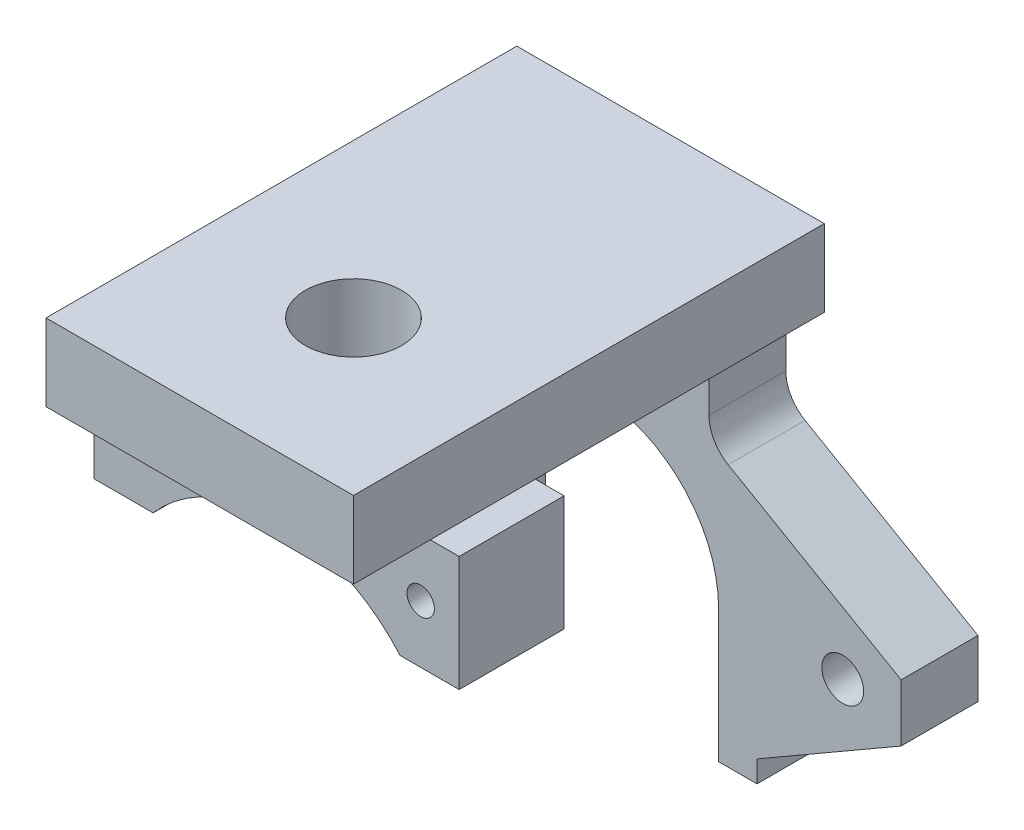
ISO-10303-21;
HEADER;
FILE_DESCRIPTION(('STEP AP214'),'2;1');
FILE_NAME('part.step','',(''),(''),'','','');
FILE_SCHEMA(('AUTOMOTIVE_DESIGN { 1 0 10303 214 1 1 1 1 }'));
ENDSEC;
DATA;
#1=APPLICATION_CONTEXT('core data for automotive mechanical design processes');
#2=APPLICATION_PROTOCOL_DEFINITION('international standard','automotive_design',2000,#1);
#3=PRODUCT_CONTEXT('',#1,'mechanical');
#4=PRODUCT('Part','Part','',(#3));
#5=PRODUCT_RELATED_PRODUCT_CATEGORY('part','',(#4));
#6=PRODUCT_DEFINITION_FORMATION('','',#4);
#7=PRODUCT_DEFINITION_CONTEXT('part definition',#1,'design');
#8=PRODUCT_DEFINITION('design','',#6,#7);
#9=PRODUCT_DEFINITION_SHAPE('','',#8);
#10=(LENGTH_UNIT() NAMED_UNIT(*) SI_UNIT(.MILLI.,.METRE.));
#11=(NAMED_UNIT(*) PLANE_ANGLE_UNIT() SI_UNIT($,.RADIAN.));
#12=(NAMED_UNIT(*) SI_UNIT($,.STERADIAN.) SOLID_ANGLE_UNIT());
#13=UNCERTAINTY_MEASURE_WITH_UNIT(LENGTH_MEASURE(1.E-05),#10,'distance_accuracy_value','');
#14=(GEOMETRIC_REPRESENTATION_CONTEXT(3) GLOBAL_UNCERTAINTY_ASSIGNED_CONTEXT((#13)) GLOBAL_UNIT_ASSIGNED_CONTEXT((#10,
#11,#12)) REPRESENTATION_CONTEXT('',''));
#15=CARTESIAN_POINT('',(0.,0.,0.));
#16=DIRECTION('',(0.,0.,1.));
#17=DIRECTION('',(1.,0.,0.));
#18=AXIS2_PLACEMENT_3D('',#15,#16,#17);
#19=CARTESIAN_POINT('',(25.4,0.,0.));
#20=DIRECTION('',(0.,0.,1.));
#21=DIRECTION('',(0.,-1.,0.));
#22=AXIS2_PLACEMENT_3D('',#19,#20,#21);
#23=PLANE('',#22);
#24=CARTESIAN_POINT('',(20.5739960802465,-25.4889,0.));
#25=DIRECTION('',(0.,0.,-1.));
#26=DIRECTION('',(0.,1.,0.));
#27=AXIS2_PLACEMENT_3D('',#24,#25,#26);
#28=CIRCLE('',#27,1.72719999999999);
#29=CARTESIAN_POINT('',(20.5739960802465,-23.7617,0.));
#30=VERTEX_POINT('',#29);
#31=EDGE_CURVE('E359',#30,#30,#28,.T.);
#32=ORIENTED_EDGE('',*,*,#31,.F.);
#33=EDGE_LOOP('',(#32));
#34=FACE_BOUND('',#33,.T.);
#35=CARTESIAN_POINT('',(-20.5740039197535,-25.4889,0.));
#36=DIRECTION('',(0.,0.,-1.));
#37=DIRECTION('',(0.,1.,0.));
#38=AXIS2_PLACEMENT_3D('',#35,#36,#37);
#39=CIRCLE('',#38,1.72719999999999);
#40=CARTESIAN_POINT('',(-20.5740039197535,-23.7617,0.));
#41=VERTEX_POINT('',#40);
#42=EDGE_CURVE('E353',#41,#41,#39,.T.);
#43=ORIENTED_EDGE('',*,*,#42,.F.);
#44=EDGE_LOOP('',(#43));
#45=FACE_BOUND('',#44,.T.);
#46=DIRECTION('',(-0.866025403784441,0.499999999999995,0.));
#47=VECTOR('',#46,1.);
#48=CARTESIAN_POINT('',(-25.4,-27.8511,0.));
#49=LINE('',#48,#47);
#50=CARTESIAN_POINT('',(-13.49375,-34.7251766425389,0.));
#51=VERTEX_POINT('',#50);
#52=CARTESIAN_POINT('',(-25.4,-27.8511,0.));
#53=VERTEX_POINT('',#52);
#54=EDGE_CURVE('E450',#51,#53,#49,.T.);
#55=ORIENTED_EDGE('',*,*,#54,.T.);
#56=DIRECTION('',(0.,1.,0.));
#57=VECTOR('',#56,1.);
#58=CARTESIAN_POINT('',(-25.4,0.,0.));
#59=LINE('',#58,#57);
#60=CARTESIAN_POINT('',(-25.4,-23.1174572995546,0.));
#61=VERTEX_POINT('',#60);
#62=EDGE_CURVE('E453',#53,#61,#59,.T.);
#63=ORIENTED_EDGE('',*,*,#62,.T.);
#64=DIRECTION('',(0.866025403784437,0.500000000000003,0.));
#65=VECTOR('',#64,1.);
#66=CARTESIAN_POINT('',(-25.4,-23.1174572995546,0.));
#67=LINE('',#66,#65);
#68=CARTESIAN_POINT('',(-11.1125,-14.8685653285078,0.));
#69=VERTEX_POINT('',#68);
#70=EDGE_CURVE('E1061',#61,#69,#67,.T.);
#71=ORIENTED_EDGE('',*,*,#70,.T.);
#72=CARTESIAN_POINT('',(-12.7,-12.1189346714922,0.));
#73=DIRECTION('',(0.,0.,1.));
#74=DIRECTION('',(1.,0.,0.));
#75=AXIS2_PLACEMENT_3D('',#72,#73,#74);
#76=CIRCLE('',#75,3.17500000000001);
#77=CARTESIAN_POINT('',(-9.525,-12.1189346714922,0.));
#78=VERTEX_POINT('',#77);
#79=EDGE_CURVE('E1063',#69,#78,#76,.T.);
#80=ORIENTED_EDGE('',*,*,#79,.T.);
#81=DIRECTION('',(0.,1.,0.));
#82=VECTOR('',#81,1.);
#83=CARTESIAN_POINT('',(-9.52500000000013,-9.525,0.));
#84=LINE('',#83,#82);
#85=CARTESIAN_POINT('',(-9.52500000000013,-9.525,0.));
#86=VERTEX_POINT('',#85);
#87=EDGE_CURVE('E505',#78,#86,#84,.T.);
#88=ORIENTED_EDGE('',*,*,#87,.T.);
#89=CARTESIAN_POINT('',(-12.7000000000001,-9.525,0.));
#90=DIRECTION('',(0.,0.,1.));
#91=DIRECTION('',(1.,0.,0.));
#92=AXIS2_PLACEMENT_3D('',#89,#90,#91);
#93=CIRCLE('',#92,3.175);
#94=CARTESIAN_POINT('',(-12.7,-6.35,0.));
#95=VERTEX_POINT('',#94);
#96=EDGE_CURVE('E500',#86,#95,#93,.T.);
#97=ORIENTED_EDGE('',*,*,#96,.T.);
#98=DIRECTION('',(0.,1.,0.));
#99=VECTOR('',#98,1.);
#100=CARTESIAN_POINT('',(-12.7,0.,0.));
#101=LINE('',#100,#99);
#102=CARTESIAN_POINT('',(-12.7,0.,0.));
#103=VERTEX_POINT('',#102);
#104=EDGE_CURVE('E497',#95,#103,#101,.T.);
#105=ORIENTED_EDGE('',*,*,#104,.T.);
#106=DIRECTION('',(-1.,0.,0.));
#107=VECTOR('',#106,1.);
#108=CARTESIAN_POINT('',(25.4,0.,0.));
#109=LINE('',#108,#107);
#110=CARTESIAN_POINT('',(12.7,0.,0.));
#111=VERTEX_POINT('',#110);
#112=EDGE_CURVE('E49',#111,#103,#109,.T.);
#113=ORIENTED_EDGE('',*,*,#112,.F.);
#114=DIRECTION('',(0.,-1.,0.));
#115=VECTOR('',#114,1.);
#116=CARTESIAN_POINT('',(12.7,0.,0.));
#117=LINE('',#116,#115);
#118=CARTESIAN_POINT('',(12.7,-6.35,0.));
#119=VERTEX_POINT('',#118);
#120=EDGE_CURVE('E494',#111,#119,#117,.T.);
#121=ORIENTED_EDGE('',*,*,#120,.T.);
#122=CARTESIAN_POINT('',(12.7000000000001,-9.525,0.));
#123=DIRECTION('',(0.,0.,1.));
#124=DIRECTION('',(-1.,0.,0.));
#125=AXIS2_PLACEMENT_3D('',#122,#123,#124);
#126=CIRCLE('',#125,3.175);
#127=CARTESIAN_POINT('',(9.52500000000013,-9.525,0.));
#128=VERTEX_POINT('',#127);
#129=EDGE_CURVE('E547',#119,#128,#126,.T.);
#130=ORIENTED_EDGE('',*,*,#129,.T.);
#131=DIRECTION('',(0.,-1.,0.));
#132=VECTOR('',#131,1.);
#133=CARTESIAN_POINT('',(9.52500000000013,-9.525,0.));
#134=LINE('',#133,#132);
#135=CARTESIAN_POINT('',(9.52500000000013,-12.1189346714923,0.));
#136=VERTEX_POINT('',#135);
#137=EDGE_CURVE('E549',#128,#136,#134,.T.);
#138=ORIENTED_EDGE('',*,*,#137,.T.);
#139=CARTESIAN_POINT('',(12.7,-12.1189346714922,0.));
#140=DIRECTION('',(0.,0.,1.));
#141=DIRECTION('',(-1.,0.,0.));
#142=AXIS2_PLACEMENT_3D('',#139,#140,#141);
#143=CIRCLE('',#142,3.17499999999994);
#144=CARTESIAN_POINT('',(11.1125000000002,-14.8685653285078,0.));
#145=VERTEX_POINT('',#144);
#146=EDGE_CURVE('E552',#136,#145,#143,.T.);
#147=ORIENTED_EDGE('',*,*,#146,.T.);
#148=DIRECTION('',(0.866025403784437,-0.500000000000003,0.));
#149=VECTOR('',#148,1.);
#150=CARTESIAN_POINT('',(25.4,-23.1174572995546,0.));
#151=LINE('',#150,#149);
#152=CARTESIAN_POINT('',(25.4,-23.1174572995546,0.));
#153=VERTEX_POINT('',#152);
#154=EDGE_CURVE('E555',#145,#153,#151,.T.);
#155=ORIENTED_EDGE('',*,*,#154,.T.);
#156=DIRECTION('',(0.,1.,0.));
#157=VECTOR('',#156,1.);
#158=CARTESIAN_POINT('',(25.4,0.,0.));
#159=LINE('',#158,#157);
#160=CARTESIAN_POINT('',(25.4,-27.8511,0.));
#161=VERTEX_POINT('',#160);
#162=EDGE_CURVE('E469',#161,#153,#159,.T.);
#163=ORIENTED_EDGE('',*,*,#162,.F.);
#164=DIRECTION('',(-0.866025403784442,-0.499999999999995,0.));
#165=VECTOR('',#164,1.);
#166=CARTESIAN_POINT('',(25.4,-27.8511,0.));
#167=LINE('',#166,#165);
#168=CARTESIAN_POINT('',(13.49375,-34.7251766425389,0.));
#169=VERTEX_POINT('',#168);
#170=EDGE_CURVE('E521',#161,#169,#167,.T.);
#171=ORIENTED_EDGE('',*,*,#170,.T.);
#172=DIRECTION('',(0.,-1.,0.));
#173=VECTOR('',#172,1.);
#174=CARTESIAN_POINT('',(13.49375,-34.7251766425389,0.));
#175=LINE('',#174,#173);
#176=CARTESIAN_POINT('',(13.49375,-36.5125,0.));
#177=VERTEX_POINT('',#176);
#178=EDGE_CURVE('E524',#169,#177,#175,.T.);
#179=ORIENTED_EDGE('',*,*,#178,.T.);
#180=DIRECTION('',(-1.,0.,0.));
#181=VECTOR('',#180,1.);
#182=CARTESIAN_POINT('',(25.4,-36.5125,0.));
#183=LINE('',#182,#181);
#184=CARTESIAN_POINT('',(10.31875,-36.5125,0.));
#185=VERTEX_POINT('',#184);
#186=EDGE_CURVE('E478',#177,#185,#183,.T.);
#187=ORIENTED_EDGE('',*,*,#186,.T.);
#188=DIRECTION('',(0.,-1.,0.));
#189=VECTOR('',#188,1.);
#190=CARTESIAN_POINT('',(10.31875,-25.5016,0.));
#191=LINE('',#190,#189);
#192=CARTESIAN_POINT('',(10.31875,-25.5016,0.));
#193=VERTEX_POINT('',#192);
#194=EDGE_CURVE('E588',#193,#185,#191,.T.);
#195=ORIENTED_EDGE('',*,*,#194,.F.);
#196=CARTESIAN_POINT('',(0.,-25.5016,0.));
#197=DIRECTION('',(0.,0.,-1.));
#198=DIRECTION('',(0.,1.,0.));
#199=AXIS2_PLACEMENT_3D('',#196,#197,#198);
#200=CIRCLE('',#199,10.31875);
#201=CARTESIAN_POINT('',(-10.31875,-25.5016,0.));
#202=VERTEX_POINT('',#201);
#203=EDGE_CURVE('E591',#202,#193,#200,.T.);
#204=ORIENTED_EDGE('',*,*,#203,.F.);
#205=DIRECTION('',(0.,1.,0.));
#206=VECTOR('',#205,1.);
#207=CARTESIAN_POINT('',(-10.31875,-25.5016,0.));
#208=LINE('',#207,#206);
#209=CARTESIAN_POINT('',(-10.31875,-36.5125,0.));
#210=VERTEX_POINT('',#209);
#211=EDGE_CURVE('E584',#210,#202,#208,.T.);
#212=ORIENTED_EDGE('',*,*,#211,.F.);
#213=CARTESIAN_POINT('',(-13.49375,-36.5125,0.));
#214=VERTEX_POINT('',#213);
#215=EDGE_CURVE('E481',#210,#214,#183,.T.);
#216=ORIENTED_EDGE('',*,*,#215,.T.);
#217=DIRECTION('',(0.,1.,0.));
#218=VECTOR('',#217,1.);
#219=CARTESIAN_POINT('',(-13.49375,-34.7251766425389,0.));
#220=LINE('',#219,#218);
#221=EDGE_CURVE('E63',#214,#51,#220,.T.);
#222=ORIENTED_EDGE('',*,*,#221,.T.);
#223=EDGE_LOOP('',(#55,#63,#71,#80,#88,#97,#105,#113,#121,#130,#138,#147,#155,#163,#171,#179,
#187,#195,#204,#212,#216,#222));
#224=FACE_BOUND('',#223,.T.);
#225=ADVANCED_FACE('F42',(#34,#45,#224),#23,.F.);
#226=CARTESIAN_POINT('',(25.4,-6.35,6.35));
#227=DIRECTION('',(0.,0.,-1.));
#228=DIRECTION('',(0.,1.,0.));
#229=AXIS2_PLACEMENT_3D('',#226,#227,#228);
#230=PLANE('',#229);
#231=CARTESIAN_POINT('',(20.5739960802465,-25.4889,6.35));
#232=DIRECTION('',(0.,0.,-1.));
#233=DIRECTION('',(0.,1.,0.));
#234=AXIS2_PLACEMENT_3D('',#231,#232,#233);
#235=CIRCLE('',#234,1.72719999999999);
#236=CARTESIAN_POINT('',(20.5739960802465,-23.7617,6.35));
#237=VERTEX_POINT('',#236);
#238=EDGE_CURVE('E356',#237,#237,#235,.T.);
#239=ORIENTED_EDGE('',*,*,#238,.T.);
#240=EDGE_LOOP('',(#239));
#241=FACE_BOUND('',#240,.T.);
#242=CARTESIAN_POINT('',(-20.5740039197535,-25.4889,6.35));
#243=DIRECTION('',(0.,0.,-1.));
#244=DIRECTION('',(0.,1.,0.));
#245=AXIS2_PLACEMENT_3D('',#242,#243,#244);
#246=CIRCLE('',#245,1.72719999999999);
#247=CARTESIAN_POINT('',(-20.5740039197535,-23.7617,6.35));
#248=VERTEX_POINT('',#247);
#249=EDGE_CURVE('E350',#248,#248,#246,.T.);
#250=ORIENTED_EDGE('',*,*,#249,.T.);
#251=EDGE_LOOP('',(#250));
#252=FACE_BOUND('',#251,.T.);
#253=DIRECTION('',(0.866025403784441,-0.499999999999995,0.));
#254=VECTOR('',#253,1.);
#255=CARTESIAN_POINT('',(-25.4,-27.8511,6.34999999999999));
#256=LINE('',#255,#254);
#257=CARTESIAN_POINT('',(-25.4,-27.8511,6.35));
#258=VERTEX_POINT('',#257);
#259=CARTESIAN_POINT('',(-13.49375,-34.7251766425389,6.34999999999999));
#260=VERTEX_POINT('',#259);
#261=EDGE_CURVE('E457',#258,#260,#256,.T.);
#262=ORIENTED_EDGE('',*,*,#261,.T.);
#263=DIRECTION('',(0.,-1.,0.));
#264=VECTOR('',#263,1.);
#265=CARTESIAN_POINT('',(-13.49375,-34.7251766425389,6.34999999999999));
#266=LINE('',#265,#264);
#267=CARTESIAN_POINT('',(-13.49375,-36.5125,6.34999999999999));
#268=VERTEX_POINT('',#267);
#269=EDGE_CURVE('E1036',#260,#268,#266,.T.);
#270=ORIENTED_EDGE('',*,*,#269,.T.);
#271=DIRECTION('',(-1.,0.,0.));
#272=VECTOR('',#271,1.);
#273=CARTESIAN_POINT('',(25.4,-36.5125,6.35));
#274=LINE('',#273,#272);
#275=CARTESIAN_POINT('',(-10.31875,-36.5125,6.34999999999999));
#276=VERTEX_POINT('',#275);
#277=EDGE_CURVE('E480',#276,#268,#274,.T.);
#278=ORIENTED_EDGE('',*,*,#277,.F.);
#279=DIRECTION('',(0.,-1.,0.));
#280=VECTOR('',#279,1.);
#281=CARTESIAN_POINT('',(-10.31875,-25.5016,6.34999999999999));
#282=LINE('',#281,#280);
#283=CARTESIAN_POINT('',(-10.31875,-25.5016,6.34999999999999));
#284=VERTEX_POINT('',#283);
#285=EDGE_CURVE('E594',#284,#276,#282,.T.);
#286=ORIENTED_EDGE('',*,*,#285,.F.);
#287=CARTESIAN_POINT('',(0.,-25.5016,6.34999999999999));
#288=DIRECTION('',(0.,0.,-1.));
#289=DIRECTION('',(0.,1.,0.));
#290=AXIS2_PLACEMENT_3D('',#287,#288,#289);
#291=CIRCLE('',#290,10.31875);
#292=CARTESIAN_POINT('',(10.31875,-25.5016,6.34999999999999));
#293=VERTEX_POINT('',#292);
#294=EDGE_CURVE('E596',#293,#284,#291,.F.);
#295=ORIENTED_EDGE('',*,*,#294,.F.);
#296=DIRECTION('',(0.,1.,0.));
#297=VECTOR('',#296,1.);
#298=CARTESIAN_POINT('',(10.31875,-25.5016,6.34999999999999));
#299=LINE('',#298,#297);
#300=CARTESIAN_POINT('',(10.31875,-36.5125,6.34999999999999));
#301=VERTEX_POINT('',#300);
#302=EDGE_CURVE('E467',#301,#293,#299,.T.);
#303=ORIENTED_EDGE('',*,*,#302,.F.);
#304=CARTESIAN_POINT('',(13.49375,-36.5125,6.35));
#305=VERTEX_POINT('',#304);
#306=EDGE_CURVE('E482',#305,#301,#274,.T.);
#307=ORIENTED_EDGE('',*,*,#306,.F.);
#308=DIRECTION('',(0.,1.,0.));
#309=VECTOR('',#308,1.);
#310=CARTESIAN_POINT('',(13.49375,-34.7251766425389,6.34999999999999));
#311=LINE('',#310,#309);
#312=CARTESIAN_POINT('',(13.49375,-34.7251766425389,6.34999999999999));
#313=VERTEX_POINT('',#312);
#314=EDGE_CURVE('E515',#305,#313,#311,.T.);
#315=ORIENTED_EDGE('',*,*,#314,.T.);
#316=DIRECTION('',(0.866025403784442,0.499999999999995,0.));
#317=VECTOR('',#316,1.);
#318=CARTESIAN_POINT('',(25.4,-27.8511,6.34999999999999));
#319=LINE('',#318,#317);
#320=CARTESIAN_POINT('',(25.4,-27.8511,6.35));
#321=VERTEX_POINT('',#320);
#322=EDGE_CURVE('E518',#313,#321,#319,.T.);
#323=ORIENTED_EDGE('',*,*,#322,.T.);
#324=DIRECTION('',(0.,-1.,0.));
#325=VECTOR('',#324,1.);
#326=CARTESIAN_POINT('',(25.4,-6.35,6.35));
#327=LINE('',#326,#325);
#328=CARTESIAN_POINT('',(25.4,-23.1174572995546,6.34999999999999));
#329=VERTEX_POINT('',#328);
#330=EDGE_CURVE('E475',#329,#321,#327,.T.);
#331=ORIENTED_EDGE('',*,*,#330,.F.);
#332=DIRECTION('',(-0.866025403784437,0.500000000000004,0.));
#333=VECTOR('',#332,1.);
#334=CARTESIAN_POINT('',(25.4,-23.1174572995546,6.34999999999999));
#335=LINE('',#334,#333);
#336=CARTESIAN_POINT('',(11.1125000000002,-14.8685653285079,6.35));
#337=VERTEX_POINT('',#336);
#338=EDGE_CURVE('E534',#329,#337,#335,.T.);
#339=ORIENTED_EDGE('',*,*,#338,.T.);
#340=CARTESIAN_POINT('',(12.7,-12.1189346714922,6.34999999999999));
#341=DIRECTION('',(0.,0.,-1.));
#342=DIRECTION('',(0.,1.,0.));
#343=AXIS2_PLACEMENT_3D('',#340,#341,#342);
#344=CIRCLE('',#343,3.17499999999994);
#345=CARTESIAN_POINT('',(9.52500000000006,-12.1189346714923,6.34999999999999));
#346=VERTEX_POINT('',#345);
#347=EDGE_CURVE('E537',#337,#346,#344,.T.);
#348=ORIENTED_EDGE('',*,*,#347,.T.);
#349=DIRECTION('',(0.,1.,0.));
#350=VECTOR('',#349,1.);
#351=CARTESIAN_POINT('',(9.52500000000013,-9.52499999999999,6.34999999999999));
#352=LINE('',#351,#350);
#353=CARTESIAN_POINT('',(9.52500000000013,-9.525,6.34999999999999));
#354=VERTEX_POINT('',#353);
#355=EDGE_CURVE('E540',#346,#354,#352,.T.);
#356=ORIENTED_EDGE('',*,*,#355,.T.);
#357=CARTESIAN_POINT('',(12.7000000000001,-9.525,6.34999999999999));
#358=DIRECTION('',(0.,0.,-1.));
#359=DIRECTION('',(0.,1.,0.));
#360=AXIS2_PLACEMENT_3D('',#357,#358,#359);
#361=CIRCLE('',#360,3.175);
#362=CARTESIAN_POINT('',(12.7,-6.35,6.35));
#363=VERTEX_POINT('',#362);
#364=EDGE_CURVE('E543',#354,#363,#361,.T.);
#365=ORIENTED_EDGE('',*,*,#364,.T.);
#366=DIRECTION('',(-1.,0.,0.));
#367=VECTOR('',#366,1.);
#368=CARTESIAN_POINT('',(25.4,-6.35,6.35));
#369=LINE('',#368,#367);
#370=CARTESIAN_POINT('',(-12.7,-6.35,6.35));
#371=VERTEX_POINT('',#370);
#372=EDGE_CURVE('E484',#363,#371,#369,.T.);
#373=ORIENTED_EDGE('',*,*,#372,.T.);
#374=CARTESIAN_POINT('',(-12.7000000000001,-9.525,6.34999999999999));
#375=DIRECTION('',(0.,0.,-1.));
#376=DIRECTION('',(0.,1.,0.));
#377=AXIS2_PLACEMENT_3D('',#374,#375,#376);
#378=CIRCLE('',#377,3.175);
#379=CARTESIAN_POINT('',(-9.52500000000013,-9.525,6.34999999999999));
#380=VERTEX_POINT('',#379);
#381=EDGE_CURVE('E1050',#371,#380,#378,.T.);
#382=ORIENTED_EDGE('',*,*,#381,.T.);
#383=DIRECTION('',(0.,-1.,0.));
#384=VECTOR('',#383,1.);
#385=CARTESIAN_POINT('',(-9.52500000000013,-9.52499999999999,6.34999999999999));
#386=LINE('',#385,#384);
#387=CARTESIAN_POINT('',(-9.525,-12.1189346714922,6.34999999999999));
#388=VERTEX_POINT('',#387);
#389=EDGE_CURVE('E1053',#380,#388,#386,.T.);
#390=ORIENTED_EDGE('',*,*,#389,.T.);
#391=CARTESIAN_POINT('',(-12.7,-12.1189346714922,6.34999999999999));
#392=DIRECTION('',(0.,0.,-1.));
#393=DIRECTION('',(0.,1.,0.));
#394=AXIS2_PLACEMENT_3D('',#391,#392,#393);
#395=CIRCLE('',#394,3.17500000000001);
#396=CARTESIAN_POINT('',(-11.1125,-14.8685653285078,6.34999999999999));
#397=VERTEX_POINT('',#396);
#398=EDGE_CURVE('E1056',#388,#397,#395,.T.);
#399=ORIENTED_EDGE('',*,*,#398,.T.);
#400=DIRECTION('',(-0.866025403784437,-0.500000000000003,0.));
#401=VECTOR('',#400,1.);
#402=CARTESIAN_POINT('',(-25.4,-23.1174572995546,6.34999999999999));
#403=LINE('',#402,#401);
#404=CARTESIAN_POINT('',(-25.4,-23.1174572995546,6.35));
#405=VERTEX_POINT('',#404);
#406=EDGE_CURVE('E1059',#397,#405,#403,.T.);
#407=ORIENTED_EDGE('',*,*,#406,.T.);
#408=DIRECTION('',(0.,-1.,0.));
#409=VECTOR('',#408,1.);
#410=CARTESIAN_POINT('',(-25.4,-6.35,6.35));
#411=LINE('',#410,#409);
#412=EDGE_CURVE('E466',#405,#258,#411,.T.);
#413=ORIENTED_EDGE('',*,*,#412,.T.);
#414=EDGE_LOOP('',(#262,#270,#278,#286,#295,#303,#307,#315,#323,#331,#339,#348,#356,#365,#373,
#382,#390,#399,#407,#413));
#415=FACE_BOUND('',#414,.T.);
#416=ADVANCED_FACE('F436',(#241,#252,#415),#230,.F.);
#417=CARTESIAN_POINT('',(-25.4,0.,0.));
#418=DIRECTION('',(-1.,0.,0.));
#419=DIRECTION('',(0.,0.,1.));
#420=AXIS2_PLACEMENT_3D('',#417,#418,#419);
#421=PLANE('',#420);
#422=ORIENTED_EDGE('',*,*,#62,.F.);
#423=DIRECTION('',(0.,0.,-1.));
#424=VECTOR('',#423,1.);
#425=CARTESIAN_POINT('',(-25.4,-27.8511,81.789));
#426=LINE('',#425,#424);
#427=EDGE_CURVE('E463',#258,#53,#426,.T.);
#428=ORIENTED_EDGE('',*,*,#427,.F.);
#429=ORIENTED_EDGE('',*,*,#412,.F.);
#430=DIRECTION('',(0.,0.,-1.));
#431=VECTOR('',#430,1.);
#432=CARTESIAN_POINT('',(-25.4,-23.1174572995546,81.789));
#433=LINE('',#432,#431);
#434=EDGE_CURVE('E465',#405,#61,#433,.T.);
#435=ORIENTED_EDGE('',*,*,#434,.T.);
#436=EDGE_LOOP('',(#422,#428,#429,#435));
#437=FACE_BOUND('',#436,.T.);
#438=ADVANCED_FACE('F441',(#437),#421,.T.);
#439=CARTESIAN_POINT('',(25.4,-36.5125,6.35));
#440=DIRECTION('',(0.,1.,0.));
#441=DIRECTION('',(0.,0.,1.));
#442=AXIS2_PLACEMENT_3D('',#439,#440,#441);
#443=PLANE('',#442);
#444=DIRECTION('',(0.,0.,-1.));
#445=VECTOR('',#444,1.);
#446=CARTESIAN_POINT('',(-13.49375,-36.5125,81.789));
#447=LINE('',#446,#445);
#448=EDGE_CURVE('E1046',#268,#214,#447,.T.);
#449=ORIENTED_EDGE('',*,*,#448,.T.);
#450=ORIENTED_EDGE('',*,*,#215,.F.);
#451=DIRECTION('',(0.,0.,-1.));
#452=VECTOR('',#451,1.);
#453=CARTESIAN_POINT('',(-10.31875,-36.5125,81.789));
#454=LINE('',#453,#452);
#455=EDGE_CURVE('E599',#276,#210,#454,.T.);
#456=ORIENTED_EDGE('',*,*,#455,.F.);
#457=ORIENTED_EDGE('',*,*,#277,.T.);
#458=EDGE_LOOP('',(#449,#450,#456,#457));
#459=FACE_BOUND('',#458,.T.);
#460=ADVANCED_FACE('F694',(#459),#443,.F.);
#461=CARTESIAN_POINT('',(25.4,0.,0.));
#462=DIRECTION('',(0.,-1.,0.));
#463=DIRECTION('',(0.,0.,-1.));
#464=AXIS2_PLACEMENT_3D('',#461,#462,#463);
#465=PLANE('',#464);
#466=CARTESIAN_POINT('',(0.,0.,26.19375));
#467=DIRECTION('',(0.,-1.,0.));
#468=DIRECTION('',(0.,0.,-1.));
#469=AXIS2_PLACEMENT_3D('',#466,#467,#468);
#470=CIRCLE('',#469,3.96875);
#471=CARTESIAN_POINT('',(0.,0.,22.225));
#472=VERTEX_POINT('',#471);
#473=EDGE_CURVE('E362',#472,#472,#470,.F.);
#474=ORIENTED_EDGE('',*,*,#473,.F.);
#475=EDGE_LOOP('',(#474));
#476=FACE_BOUND('',#475,.T.);
#477=DIRECTION('',(0.,0.,1.));
#478=VECTOR('',#477,1.);
#479=CARTESIAN_POINT('',(-12.7,0.,81.788));
#480=LINE('',#479,#478);
#481=CARTESIAN_POINT('',(-12.7,0.,38.89375));
#482=VERTEX_POINT('',#481);
#483=EDGE_CURVE('E281',#103,#482,#480,.T.);
#484=ORIENTED_EDGE('',*,*,#483,.T.);
#485=DIRECTION('',(1.,0.,0.));
#486=VECTOR('',#485,1.);
#487=CARTESIAN_POINT('',(25.4,0.,38.89375));
#488=LINE('',#487,#486);
#489=CARTESIAN_POINT('',(12.7,0.,38.89375));
#490=VERTEX_POINT('',#489);
#491=EDGE_CURVE('E56',#482,#490,#488,.T.);
#492=ORIENTED_EDGE('',*,*,#491,.T.);
#493=DIRECTION('',(0.,0.,-1.));
#494=VECTOR('',#493,1.);
#495=CARTESIAN_POINT('',(12.7,0.,81.788));
#496=LINE('',#495,#494);
#497=EDGE_CURVE('E489',#490,#111,#496,.T.);
#498=ORIENTED_EDGE('',*,*,#497,.T.);
#499=ORIENTED_EDGE('',*,*,#112,.T.);
#500=EDGE_LOOP('',(#484,#492,#498,#499));
#501=FACE_BOUND('',#500,.T.);
#502=ADVANCED_FACE('F487',(#476,#501),#465,.F.);
#503=CARTESIAN_POINT('',(25.4,0.,0.));
#504=DIRECTION('',(-1.,0.,0.));
#505=DIRECTION('',(0.,0.,1.));
#506=AXIS2_PLACEMENT_3D('',#503,#504,#505);
#507=PLANE('',#506);
#508=DIRECTION('',(0.,0.,-1.));
#509=VECTOR('',#508,1.);
#510=CARTESIAN_POINT('',(25.4,-27.8511,81.789));
#511=LINE('',#510,#509);
#512=EDGE_CURVE('E531',#321,#161,#511,.T.);
#513=ORIENTED_EDGE('',*,*,#512,.T.);
#514=ORIENTED_EDGE('',*,*,#162,.T.);
#515=DIRECTION('',(0.,0.,-1.));
#516=VECTOR('',#515,1.);
#517=CARTESIAN_POINT('',(25.4,-23.1174572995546,81.789));
#518=LINE('',#517,#516);
#519=EDGE_CURVE('E558',#329,#153,#518,.T.);
#520=ORIENTED_EDGE('',*,*,#519,.F.);
#521=ORIENTED_EDGE('',*,*,#330,.T.);
#522=EDGE_LOOP('',(#513,#514,#520,#521));
#523=FACE_BOUND('',#522,.T.);
#524=ADVANCED_FACE('F688',(#523),#507,.F.);
#525=DIRECTION('',(0.,0.,-1.));
#526=VECTOR('',#525,1.);
#527=CARTESIAN_POINT('',(13.49375,-36.5125,81.789));
#528=LINE('',#527,#526);
#529=EDGE_CURVE('E527',#305,#177,#528,.T.);
#530=ORIENTED_EDGE('',*,*,#529,.F.);
#531=ORIENTED_EDGE('',*,*,#306,.T.);
#532=DIRECTION('',(0.,0.,1.));
#533=VECTOR('',#532,1.);
#534=CARTESIAN_POINT('',(10.31875,-36.5125,81.789));
#535=LINE('',#534,#533);
#536=EDGE_CURVE('E601',#185,#301,#535,.T.);
#537=ORIENTED_EDGE('',*,*,#536,.F.);
#538=ORIENTED_EDGE('',*,*,#186,.F.);
#539=EDGE_LOOP('',(#530,#531,#537,#538));
#540=FACE_BOUND('',#539,.T.);
#541=ADVANCED_FACE('F691',(#540),#443,.F.);
#542=CARTESIAN_POINT('',(15.08125,-6.35000000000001,23.86965));
#543=DIRECTION('',(0.,0.,1.));
#544=DIRECTION('',(1.,0.,0.));
#545=AXIS2_PLACEMENT_3D('',#542,#543,#544);
#546=PLANE('',#545);
#547=CARTESIAN_POINT('',(-11.90625,-11.1125,23.86965));
#548=DIRECTION('',(0.,0.,1.));
#549=DIRECTION('',(1.,0.,0.));
#550=AXIS2_PLACEMENT_3D('',#547,#548,#549);
#551=CIRCLE('',#550,1.13029999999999);
#552=CARTESIAN_POINT('',(-10.77595,-11.1125,23.86965));
#553=VERTEX_POINT('',#552);
#554=EDGE_CURVE('E344',#553,#553,#551,.T.);
#555=ORIENTED_EDGE('',*,*,#554,.T.);
#556=EDGE_LOOP('',(#555));
#557=FACE_BOUND('',#556,.T.);
#558=DIRECTION('',(-1.,0.,0.));
#559=VECTOR('',#558,1.);
#560=CARTESIAN_POINT('',(15.08125,-6.35000000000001,23.86965));
#561=LINE('',#560,#559);
#562=CARTESIAN_POINT('',(-3.21706943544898,-6.35000000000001,23.86965));
#563=VERTEX_POINT('',#562);
#564=CARTESIAN_POINT('',(-12.7,-6.35000000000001,23.86965));
#565=VERTEX_POINT('',#564);
#566=EDGE_CURVE('E292',#563,#565,#561,.T.);
#567=ORIENTED_EDGE('',*,*,#566,.F.);
#568=DIRECTION('',(0.,-1.,0.));
#569=VECTOR('',#568,1.);
#570=CARTESIAN_POINT('',(-3.21706943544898,0.00100000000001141,23.86965));
#571=LINE('',#570,#569);
#572=CARTESIAN_POINT('',(-3.21706943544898,-11.6032037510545,23.86965));
#573=VERTEX_POINT('',#572);
#574=EDGE_CURVE('E367',#573,#563,#571,.F.);
#575=ORIENTED_EDGE('',*,*,#574,.F.);
#576=CARTESIAN_POINT('',(0.,-24.70785,23.86965));
#577=DIRECTION('',(0.,0.,1.));
#578=DIRECTION('',(1.,0.,0.));
#579=AXIS2_PLACEMENT_3D('',#576,#577,#578);
#580=CIRCLE('',#579,13.49375);
#581=CARTESIAN_POINT('',(-10.2010808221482,-15.875,23.86965));
#582=VERTEX_POINT('',#581);
#583=EDGE_CURVE('E328',#582,#573,#580,.F.);
#584=ORIENTED_EDGE('',*,*,#583,.F.);
#585=DIRECTION('',(-1.,0.,0.));
#586=VECTOR('',#585,1.);
#587=CARTESIAN_POINT('',(15.08125,-15.875,23.86965));
#588=LINE('',#587,#586);
#589=CARTESIAN_POINT('',(-15.08125,-15.875,23.86965));
#590=VERTEX_POINT('',#589);
#591=EDGE_CURVE('E306',#582,#590,#588,.T.);
#592=ORIENTED_EDGE('',*,*,#591,.T.);
#593=DIRECTION('',(0.,1.,0.));
#594=VECTOR('',#593,1.);
#595=CARTESIAN_POINT('',(-15.08125,-6.35000000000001,23.86965));
#596=LINE('',#595,#594);
#597=CARTESIAN_POINT('',(-15.08125,-6.35000000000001,23.86965));
#598=VERTEX_POINT('',#597);
#599=EDGE_CURVE('E325',#590,#598,#596,.T.);
#600=ORIENTED_EDGE('',*,*,#599,.T.);
#601=EDGE_CURVE('E296',#565,#598,#561,.T.);
#602=ORIENTED_EDGE('',*,*,#601,.F.);
#603=EDGE_LOOP('',(#567,#575,#584,#592,#600,#602));
#604=FACE_BOUND('',#603,.T.);
#605=ADVANCED_FACE('F644',(#557,#604),#546,.F.);
#606=CARTESIAN_POINT('',(15.08125,-6.35000000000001,32.54375));
#607=DIRECTION('',(0.,0.,-1.));
#608=DIRECTION('',(-1.,0.,0.));
#609=AXIS2_PLACEMENT_3D('',#606,#607,#608);
#610=PLANE('',#609);
#611=CARTESIAN_POINT('',(11.90625,-11.1125,32.54375));
#612=DIRECTION('',(0.,0.,1.));
#613=DIRECTION('',(1.,0.,0.));
#614=AXIS2_PLACEMENT_3D('',#611,#612,#613);
#615=CIRCLE('',#614,1.13029999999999);
#616=CARTESIAN_POINT('',(13.03655,-11.1125,32.54375));
#617=VERTEX_POINT('',#616);
#618=EDGE_CURVE('E341',#617,#617,#615,.T.);
#619=ORIENTED_EDGE('',*,*,#618,.F.);
#620=EDGE_LOOP('',(#619));
#621=FACE_BOUND('',#620,.T.);
#622=DIRECTION('',(-1.,0.,0.));
#623=VECTOR('',#622,1.);
#624=CARTESIAN_POINT('',(15.08125,-15.875,32.54375));
#625=LINE('',#624,#623);
#626=CARTESIAN_POINT('',(-10.2010808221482,-15.875,32.54375));
#627=VERTEX_POINT('',#626);
#628=CARTESIAN_POINT('',(-15.08125,-15.875,32.54375));
#629=VERTEX_POINT('',#628);
#630=EDGE_CURVE('E302',#627,#629,#625,.T.);
#631=ORIENTED_EDGE('',*,*,#630,.F.);
#632=CARTESIAN_POINT('',(0.,-24.70785,32.54375));
#633=DIRECTION('',(0.,0.,1.));
#634=DIRECTION('',(1.,0.,0.));
#635=AXIS2_PLACEMENT_3D('',#632,#633,#634);
#636=CIRCLE('',#635,13.49375);
#637=CARTESIAN_POINT('',(10.2010808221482,-15.875,32.54375));
#638=VERTEX_POINT('',#637);
#639=EDGE_CURVE('E332',#638,#627,#636,.T.);
#640=ORIENTED_EDGE('',*,*,#639,.F.);
#641=CARTESIAN_POINT('',(15.08125,-15.875,32.54375));
#642=VERTEX_POINT('',#641);
#643=EDGE_CURVE('E299',#642,#638,#625,.T.);
#644=ORIENTED_EDGE('',*,*,#643,.F.);
#645=DIRECTION('',(0.,-1.,0.));
#646=VECTOR('',#645,1.);
#647=CARTESIAN_POINT('',(15.08125,-6.35000000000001,32.54375));
#648=LINE('',#647,#646);
#649=CARTESIAN_POINT('',(15.08125,-6.35000000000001,32.54375));
#650=VERTEX_POINT('',#649);
#651=EDGE_CURVE('E309',#650,#642,#648,.T.);
#652=ORIENTED_EDGE('',*,*,#651,.F.);
#653=DIRECTION('',(-1.,0.,0.));
#654=VECTOR('',#653,1.);
#655=CARTESIAN_POINT('',(15.08125,-6.35000000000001,32.54375));
#656=LINE('',#655,#654);
#657=CARTESIAN_POINT('',(12.7,-6.35000000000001,32.54375));
#658=VERTEX_POINT('',#657);
#659=EDGE_CURVE('E293',#650,#658,#656,.T.);
#660=ORIENTED_EDGE('',*,*,#659,.T.);
#661=CARTESIAN_POINT('',(-12.7,-6.35,32.54375));
#662=VERTEX_POINT('',#661);
#663=EDGE_CURVE('E297',#658,#662,#656,.T.);
#664=ORIENTED_EDGE('',*,*,#663,.T.);
#665=CARTESIAN_POINT('',(-15.08125,-6.35000000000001,32.54375));
#666=VERTEX_POINT('',#665);
#667=EDGE_CURVE('E298',#662,#666,#656,.T.);
#668=ORIENTED_EDGE('',*,*,#667,.T.);
#669=DIRECTION('',(0.,-1.,0.));
#670=VECTOR('',#669,1.);
#671=CARTESIAN_POINT('',(-15.08125,-6.35000000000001,32.54375));
#672=LINE('',#671,#670);
#673=EDGE_CURVE('E319',#666,#629,#672,.T.);
#674=ORIENTED_EDGE('',*,*,#673,.T.);
#675=EDGE_LOOP('',(#631,#640,#644,#652,#660,#664,#668,#674));
#676=FACE_BOUND('',#675,.T.);
#677=CARTESIAN_POINT('',(-11.90625,-11.1125,32.54375));
#678=DIRECTION('',(0.,0.,1.));
#679=DIRECTION('',(1.,0.,0.));
#680=AXIS2_PLACEMENT_3D('',#677,#678,#679);
#681=CIRCLE('',#680,1.13029999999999);
#682=CARTESIAN_POINT('',(-10.77595,-11.1125,32.54375));
#683=VERTEX_POINT('',#682);
#684=EDGE_CURVE('E347',#683,#683,#681,.T.);
#685=ORIENTED_EDGE('',*,*,#684,.F.);
#686=EDGE_LOOP('',(#685));
#687=FACE_BOUND('',#686,.T.);
#688=ADVANCED_FACE('F610',(#621,#676,#687),#610,.F.);
#689=CARTESIAN_POINT('',(15.08125,-15.875,23.86965));
#690=DIRECTION('',(0.,1.,0.));
#691=DIRECTION('',(-1.,0.,0.));
#692=AXIS2_PLACEMENT_3D('',#689,#690,#691);
#693=PLANE('',#692);
#694=ORIENTED_EDGE('',*,*,#591,.F.);
#695=DIRECTION('',(0.,0.,1.));
#696=VECTOR('',#695,1.);
#697=CARTESIAN_POINT('',(-10.2010808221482,-15.875,-0.00100000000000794));
#698=LINE('',#697,#696);
#699=EDGE_CURVE('E334',#627,#582,#698,.F.);
#700=ORIENTED_EDGE('',*,*,#699,.F.);
#701=ORIENTED_EDGE('',*,*,#630,.T.);
#702=DIRECTION('',(0.,0.,-1.));
#703=VECTOR('',#702,1.);
#704=CARTESIAN_POINT('',(-15.08125,-15.875,23.86965));
#705=LINE('',#704,#703);
#706=EDGE_CURVE('E316',#629,#590,#705,.T.);
#707=ORIENTED_EDGE('',*,*,#706,.T.);
#708=EDGE_LOOP('',(#694,#700,#701,#707));
#709=FACE_BOUND('',#708,.T.);
#710=ADVANCED_FACE('F646',(#709),#693,.F.);
#711=CARTESIAN_POINT('',(25.4,-6.35,6.35));
#712=DIRECTION('',(0.,1.,0.));
#713=DIRECTION('',(0.,0.,1.));
#714=AXIS2_PLACEMENT_3D('',#711,#712,#713);
#715=PLANE('',#714);
#716=CARTESIAN_POINT('',(12.7,-6.35000000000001,23.86965));
#717=VERTEX_POINT('',#716);
#718=CARTESIAN_POINT('',(3.21706943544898,-6.35000000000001,23.86965));
#719=VERTEX_POINT('',#718);
#720=EDGE_CURVE('E291',#717,#719,#561,.T.);
#721=ORIENTED_EDGE('',*,*,#720,.T.);
#722=CARTESIAN_POINT('',(0.,-6.35,26.19375));
#723=DIRECTION('',(0.,1.,0.));
#724=DIRECTION('',(0.,0.,1.));
#725=AXIS2_PLACEMENT_3D('',#722,#723,#724);
#726=CIRCLE('',#725,3.96875);
#727=EDGE_CURVE('E365',#563,#719,#726,.F.);
#728=ORIENTED_EDGE('',*,*,#727,.F.);
#729=ORIENTED_EDGE('',*,*,#566,.T.);
#730=DIRECTION('',(0.,0.,1.));
#731=VECTOR('',#730,1.);
#732=CARTESIAN_POINT('',(-12.7,-6.35000000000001,81.788));
#733=LINE('',#732,#731);
#734=EDGE_CURVE('E275',#371,#565,#733,.T.);
#735=ORIENTED_EDGE('',*,*,#734,.F.);
#736=ORIENTED_EDGE('',*,*,#372,.F.);
#737=DIRECTION('',(0.,0.,-1.));
#738=VECTOR('',#737,1.);
#739=CARTESIAN_POINT('',(12.7,-6.35000000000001,81.788));
#740=LINE('',#739,#738);
#741=EDGE_CURVE('E283',#717,#363,#740,.T.);
#742=ORIENTED_EDGE('',*,*,#741,.F.);
#743=EDGE_LOOP('',(#721,#728,#729,#735,#736,#742));
#744=FACE_BOUND('',#743,.T.);
#745=ADVANCED_FACE('F628',(#744),#715,.F.);
#746=CARTESIAN_POINT('',(12.7,-6.35,38.89375));
#747=VERTEX_POINT('',#746);
#748=EDGE_CURVE('E266',#747,#658,#740,.T.);
#749=ORIENTED_EDGE('',*,*,#748,.F.);
#750=DIRECTION('',(1.,0.,0.));
#751=VECTOR('',#750,1.);
#752=CARTESIAN_POINT('',(-12.7,-6.35,38.89375));
#753=LINE('',#752,#751);
#754=CARTESIAN_POINT('',(-12.7,-6.35,38.89375));
#755=VERTEX_POINT('',#754);
#756=EDGE_CURVE('E254',#755,#747,#753,.T.);
#757=ORIENTED_EDGE('',*,*,#756,.F.);
#758=EDGE_CURVE('E264',#662,#755,#733,.T.);
#759=ORIENTED_EDGE('',*,*,#758,.F.);
#760=ORIENTED_EDGE('',*,*,#663,.F.);
#761=EDGE_LOOP('',(#749,#757,#759,#760));
#762=FACE_BOUND('',#761,.T.);
#763=ADVANCED_FACE('F262',(#762),#715,.F.);
#764=CARTESIAN_POINT('',(0.,-25.5016,81.789));
#765=DIRECTION('',(0.,0.,-1.));
#766=DIRECTION('',(0.,1.,0.));
#767=AXIS2_PLACEMENT_3D('',#764,#765,#766);
#768=CYLINDRICAL_SURFACE('',#767,10.31875);
#769=ORIENTED_EDGE('',*,*,#294,.T.);
#770=DIRECTION('',(0.,0.,-1.));
#771=VECTOR('',#770,1.);
#772=CARTESIAN_POINT('',(-10.31875,-25.5016,81.789));
#773=LINE('',#772,#771);
#774=EDGE_CURVE('E472',#284,#202,#773,.T.);
#775=ORIENTED_EDGE('',*,*,#774,.T.);
#776=ORIENTED_EDGE('',*,*,#203,.T.);
#777=DIRECTION('',(0.,0.,-1.));
#778=VECTOR('',#777,1.);
#779=CARTESIAN_POINT('',(10.31875,-25.5016,81.789));
#780=LINE('',#779,#778);
#781=EDGE_CURVE('E582',#293,#193,#780,.T.);
#782=ORIENTED_EDGE('',*,*,#781,.F.);
#783=EDGE_LOOP('',(#769,#775,#776,#782));
#784=FACE_BOUND('',#783,.T.);
#785=ADVANCED_FACE('F680',(#784),#768,.F.);
#786=CARTESIAN_POINT('',(-10.31875,-25.5016,81.789));
#787=DIRECTION('',(-1.,0.,0.));
#788=DIRECTION('',(0.,-1.,0.));
#789=AXIS2_PLACEMENT_3D('',#786,#787,#788);
#790=PLANE('',#789);
#791=ORIENTED_EDGE('',*,*,#285,.T.);
#792=ORIENTED_EDGE('',*,*,#455,.T.);
#793=ORIENTED_EDGE('',*,*,#211,.T.);
#794=ORIENTED_EDGE('',*,*,#774,.F.);
#795=EDGE_LOOP('',(#791,#792,#793,#794));
#796=FACE_BOUND('',#795,.T.);
#797=ADVANCED_FACE('F677',(#796),#790,.F.);
#798=CARTESIAN_POINT('',(10.31875,-25.5016,81.789));
#799=DIRECTION('',(1.,0.,0.));
#800=DIRECTION('',(0.,1.,0.));
#801=AXIS2_PLACEMENT_3D('',#798,#799,#800);
#802=PLANE('',#801);
#803=ORIENTED_EDGE('',*,*,#302,.T.);
#804=ORIENTED_EDGE('',*,*,#781,.T.);
#805=ORIENTED_EDGE('',*,*,#194,.T.);
#806=ORIENTED_EDGE('',*,*,#536,.T.);
#807=EDGE_LOOP('',(#803,#804,#805,#806));
#808=FACE_BOUND('',#807,.T.);
#809=ADVANCED_FACE('F676',(#808),#802,.F.);
#810=CARTESIAN_POINT('',(12.7,0.,81.788));
#811=DIRECTION('',(-1.,0.,0.));
#812=DIRECTION('',(0.,0.,1.));
#813=AXIS2_PLACEMENT_3D('',#810,#811,#812);
#814=PLANE('',#813);
#815=ORIENTED_EDGE('',*,*,#497,.F.);
#816=DIRECTION('',(0.,-1.,0.));
#817=VECTOR('',#816,1.);
#818=CARTESIAN_POINT('',(12.7,72.39,38.89375));
#819=LINE('',#818,#817);
#820=EDGE_CURVE('E267',#490,#747,#819,.T.);
#821=ORIENTED_EDGE('',*,*,#820,.T.);
#822=ORIENTED_EDGE('',*,*,#748,.T.);
#823=DIRECTION('',(0.,0.,1.));
#824=VECTOR('',#823,1.);
#825=CARTESIAN_POINT('',(12.7,-6.35000000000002,81.788));
#826=LINE('',#825,#824);
#827=EDGE_CURVE('E273',#717,#658,#826,.T.);
#828=ORIENTED_EDGE('',*,*,#827,.F.);
#829=ORIENTED_EDGE('',*,*,#741,.T.);
#830=DIRECTION('',(0.,0.,-1.));
#831=VECTOR('',#830,1.);
#832=CARTESIAN_POINT('',(12.7,-6.35,81.789));
#833=LINE('',#832,#831);
#834=EDGE_CURVE('E378',#363,#119,#833,.T.);
#835=ORIENTED_EDGE('',*,*,#834,.T.);
#836=ORIENTED_EDGE('',*,*,#120,.F.);
#837=EDGE_LOOP('',(#815,#821,#822,#828,#829,#835,#836));
#838=FACE_BOUND('',#837,.T.);
#839=ADVANCED_FACE('F569',(#838),#814,.F.);
#840=CARTESIAN_POINT('',(-12.7,0.,81.788));
#841=DIRECTION('',(1.,0.,0.));
#842=DIRECTION('',(0.,0.,-1.));
#843=AXIS2_PLACEMENT_3D('',#840,#841,#842);
#844=PLANE('',#843);
#845=ORIENTED_EDGE('',*,*,#758,.T.);
#846=DIRECTION('',(0.,1.,0.));
#847=VECTOR('',#846,1.);
#848=CARTESIAN_POINT('',(-12.7,0.,38.89375));
#849=LINE('',#848,#847);
#850=EDGE_CURVE('E11',#755,#482,#849,.T.);
#851=ORIENTED_EDGE('',*,*,#850,.T.);
#852=ORIENTED_EDGE('',*,*,#483,.F.);
#853=ORIENTED_EDGE('',*,*,#104,.F.);
#854=DIRECTION('',(0.,0.,-1.));
#855=VECTOR('',#854,1.);
#856=CARTESIAN_POINT('',(-12.7,-6.35,81.789));
#857=LINE('',#856,#855);
#858=EDGE_CURVE('E501',#371,#95,#857,.T.);
#859=ORIENTED_EDGE('',*,*,#858,.F.);
#860=ORIENTED_EDGE('',*,*,#734,.T.);
#861=EDGE_CURVE('E272',#565,#662,#733,.T.);
#862=ORIENTED_EDGE('',*,*,#861,.T.);
#863=EDGE_LOOP('',(#845,#851,#852,#853,#859,#860,#862));
#864=FACE_BOUND('',#863,.T.);
#865=ADVANCED_FACE('F269',(#864),#844,.F.);
#866=CARTESIAN_POINT('',(15.08125,-6.35000000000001,23.86965));
#867=DIRECTION('',(0.,-1.,0.));
#868=DIRECTION('',(0.,0.,-1.));
#869=AXIS2_PLACEMENT_3D('',#866,#867,#868);
#870=PLANE('',#869);
#871=CARTESIAN_POINT('',(15.08125,-6.35000000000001,23.86965));
#872=VERTEX_POINT('',#871);
#873=EDGE_CURVE('E277',#872,#717,#561,.T.);
#874=ORIENTED_EDGE('',*,*,#873,.T.);
#875=ORIENTED_EDGE('',*,*,#827,.T.);
#876=ORIENTED_EDGE('',*,*,#659,.F.);
#877=DIRECTION('',(0.,0.,1.));
#878=VECTOR('',#877,1.);
#879=CARTESIAN_POINT('',(15.08125,-6.35000000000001,23.86965));
#880=LINE('',#879,#878);
#881=EDGE_CURVE('E311',#872,#650,#880,.T.);
#882=ORIENTED_EDGE('',*,*,#881,.F.);
#883=EDGE_LOOP('',(#874,#875,#876,#882));
#884=FACE_BOUND('',#883,.T.);
#885=ADVANCED_FACE('F605',(#884),#870,.F.);
#886=ORIENTED_EDGE('',*,*,#667,.F.);
#887=ORIENTED_EDGE('',*,*,#861,.F.);
#888=ORIENTED_EDGE('',*,*,#601,.T.);
#889=DIRECTION('',(0.,0.,1.));
#890=VECTOR('',#889,1.);
#891=CARTESIAN_POINT('',(-15.08125,-6.35000000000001,23.86965));
#892=LINE('',#891,#890);
#893=EDGE_CURVE('E322',#598,#666,#892,.T.);
#894=ORIENTED_EDGE('',*,*,#893,.T.);
#895=EDGE_LOOP('',(#886,#887,#888,#894));
#896=FACE_BOUND('',#895,.T.);
#897=ADVANCED_FACE('F621',(#896),#870,.F.);
#898=CARTESIAN_POINT('',(11.90625,-11.1125,23.86965));
#899=DIRECTION('',(0.,0.,1.));
#900=DIRECTION('',(1.,0.,0.));
#901=AXIS2_PLACEMENT_3D('',#898,#899,#900);
#902=CIRCLE('',#901,1.13029999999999);
#903=CARTESIAN_POINT('',(13.03655,-11.1125,23.86965));
#904=VERTEX_POINT('',#903);
#905=EDGE_CURVE('E338',#904,#904,#902,.T.);
#906=ORIENTED_EDGE('',*,*,#905,.T.);
#907=EDGE_LOOP('',(#906));
#908=FACE_BOUND('',#907,.T.);
#909=CARTESIAN_POINT('',(3.21706943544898,-11.6032037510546,23.86965));
#910=VERTEX_POINT('',#909);
#911=CARTESIAN_POINT('',(10.2010808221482,-15.875,23.86965));
#912=VERTEX_POINT('',#911);
#913=EDGE_CURVE('E331',#910,#912,#580,.F.);
#914=ORIENTED_EDGE('',*,*,#913,.F.);
#915=DIRECTION('',(0.,-1.,0.));
#916=VECTOR('',#915,1.);
#917=CARTESIAN_POINT('',(3.21706943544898,0.00100000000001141,23.86965));
#918=LINE('',#917,#916);
#919=EDGE_CURVE('E369',#719,#910,#918,.T.);
#920=ORIENTED_EDGE('',*,*,#919,.F.);
#921=ORIENTED_EDGE('',*,*,#720,.F.);
#922=ORIENTED_EDGE('',*,*,#873,.F.);
#923=DIRECTION('',(0.,1.,0.));
#924=VECTOR('',#923,1.);
#925=CARTESIAN_POINT('',(15.08125,-6.35000000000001,23.86965));
#926=LINE('',#925,#924);
#927=CARTESIAN_POINT('',(15.08125,-15.875,23.86965));
#928=VERTEX_POINT('',#927);
#929=EDGE_CURVE('E313',#928,#872,#926,.T.);
#930=ORIENTED_EDGE('',*,*,#929,.F.);
#931=EDGE_CURVE('E303',#928,#912,#588,.T.);
#932=ORIENTED_EDGE('',*,*,#931,.T.);
#933=EDGE_LOOP('',(#914,#920,#921,#922,#930,#932));
#934=FACE_BOUND('',#933,.T.);
#935=ADVANCED_FACE('F632',(#908,#934),#546,.F.);
#936=ORIENTED_EDGE('',*,*,#643,.T.);
#937=DIRECTION('',(0.,0.,1.));
#938=VECTOR('',#937,1.);
#939=CARTESIAN_POINT('',(10.2010808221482,-15.875,-0.00100000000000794));
#940=LINE('',#939,#938);
#941=EDGE_CURVE('E336',#912,#638,#940,.T.);
#942=ORIENTED_EDGE('',*,*,#941,.F.);
#943=ORIENTED_EDGE('',*,*,#931,.F.);
#944=DIRECTION('',(0.,0.,-1.));
#945=VECTOR('',#944,1.);
#946=CARTESIAN_POINT('',(15.08125,-15.875,23.86965));
#947=LINE('',#946,#945);
#948=EDGE_CURVE('E307',#642,#928,#947,.T.);
#949=ORIENTED_EDGE('',*,*,#948,.F.);
#950=EDGE_LOOP('',(#936,#942,#943,#949));
#951=FACE_BOUND('',#950,.T.);
#952=ADVANCED_FACE('F650',(#951),#693,.F.);
#953=CARTESIAN_POINT('',(15.08125,-15.875,23.86965));
#954=DIRECTION('',(-1.,0.,0.));
#955=DIRECTION('',(0.,0.,1.));
#956=AXIS2_PLACEMENT_3D('',#953,#954,#955);
#957=PLANE('',#956);
#958=ORIENTED_EDGE('',*,*,#929,.T.);
#959=ORIENTED_EDGE('',*,*,#881,.T.);
#960=ORIENTED_EDGE('',*,*,#651,.T.);
#961=ORIENTED_EDGE('',*,*,#948,.T.);
#962=EDGE_LOOP('',(#958,#959,#960,#961));
#963=FACE_BOUND('',#962,.T.);
#964=ADVANCED_FACE('F653',(#963),#957,.F.);
#965=CARTESIAN_POINT('',(-15.08125,-15.875,23.86965));
#966=DIRECTION('',(-1.,0.,0.));
#967=DIRECTION('',(0.,0.,1.));
#968=AXIS2_PLACEMENT_3D('',#965,#966,#967);
#969=PLANE('',#968);
#970=ORIENTED_EDGE('',*,*,#599,.F.);
#971=ORIENTED_EDGE('',*,*,#706,.F.);
#972=ORIENTED_EDGE('',*,*,#673,.F.);
#973=ORIENTED_EDGE('',*,*,#893,.F.);
#974=EDGE_LOOP('',(#970,#971,#972,#973));
#975=FACE_BOUND('',#974,.T.);
#976=ADVANCED_FACE('F620',(#975),#969,.T.);
#977=CARTESIAN_POINT('',(0.,-24.70785,-0.00100000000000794));
#978=DIRECTION('',(0.,0.,1.));
#979=DIRECTION('',(1.,0.,0.));
#980=AXIS2_PLACEMENT_3D('',#977,#978,#979);
#981=CYLINDRICAL_SURFACE('',#980,13.49375);
#982=ORIENTED_EDGE('',*,*,#583,.T.);
#983=CARTESIAN_POINT('',(3.21706943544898,-11.6032037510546,23.86965));
#984=CARTESIAN_POINT('',(3.28089246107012,-11.618874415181,23.9579802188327));
#985=CARTESIAN_POINT('',(3.34110008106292,-11.6341468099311,24.0490001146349));
#986=CARTESIAN_POINT('',(3.45390607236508,-11.6634933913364,24.2358425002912));
#987=CARTESIAN_POINT('',(3.50650318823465,-11.6775673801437,24.3316657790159));
#988=CARTESIAN_POINT('',(3.60372282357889,-11.7041194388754,24.5275779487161));
#989=CARTESIAN_POINT('',(3.64833967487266,-11.7165963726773,24.6276698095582));
#990=CARTESIAN_POINT('',(3.72920451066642,-11.7395774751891,24.8313923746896));
#991=CARTESIAN_POINT('',(3.76545308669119,-11.7500817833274,24.9350228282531));
#992=CARTESIAN_POINT('',(3.82933125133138,-11.7688151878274,25.145280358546));
#993=CARTESIAN_POINT('',(3.85694792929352,-11.7770408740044,25.2519116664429));
#994=CARTESIAN_POINT('',(3.90325357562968,-11.7909430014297,25.4673021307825));
#995=CARTESIAN_POINT('',(3.92193926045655,-11.7966185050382,25.5760620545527));
#996=CARTESIAN_POINT('',(3.9501768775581,-11.80522971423,25.7947306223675));
#997=CARTESIAN_POINT('',(3.95974029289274,-11.8081688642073,25.9046376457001));
#998=CARTESIAN_POINT('',(3.96968599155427,-11.811226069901,26.1249446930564));
#999=CARTESIAN_POINT('',(3.97006496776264,-11.8113431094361,26.2353448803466));
#1000=CARTESIAN_POINT('',(3.96173946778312,-11.8087829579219,26.4528105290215));
#1001=CARTESIAN_POINT('',(3.95327810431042,-11.8061805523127,26.5598860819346));
#1002=CARTESIAN_POINT('',(3.92773098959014,-11.7983813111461,26.7729191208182));
#1003=CARTESIAN_POINT('',(3.91064211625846,-11.7931835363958,26.8788761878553));
#1004=CARTESIAN_POINT('',(3.84661319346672,-11.773904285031,27.1939319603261));
#1005=CARTESIAN_POINT('',(3.78690487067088,-11.7561347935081,27.4003659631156));
#1006=CARTESIAN_POINT('',(3.6351414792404,-11.7127275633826,27.8008745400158));
#1007=CARTESIAN_POINT('',(3.54295890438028,-11.6870588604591,27.9948967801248));
#1008=CARTESIAN_POINT('',(3.32897251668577,-11.6307156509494,28.3650665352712));
#1009=CARTESIAN_POINT('',(3.207165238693,-11.6000405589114,28.5412119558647));
#1010=CARTESIAN_POINT('',(2.93164285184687,-11.5356248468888,28.8780883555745));
#1011=CARTESIAN_POINT('',(2.7768472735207,-11.5018107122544,29.0379221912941));
#1012=CARTESIAN_POINT('',(2.44253149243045,-11.4359127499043,29.3297108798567));
#1013=CARTESIAN_POINT('',(2.26300755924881,-11.4038291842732,29.4616615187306));
#1014=CARTESIAN_POINT('',(1.88089619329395,-11.3444145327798,29.6957704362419));
#1015=CARTESIAN_POINT('',(1.67800140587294,-11.3171625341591,29.7974487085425));
#1016=CARTESIAN_POINT('',(1.25702875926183,-11.2711120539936,29.9649753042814));
#1017=CARTESIAN_POINT('',(1.0389546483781,-11.2523114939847,30.0308324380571));
#1018=CARTESIAN_POINT('',(0.600906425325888,-11.2257557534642,30.1229285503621));
#1019=CARTESIAN_POINT('',(0.381192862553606,-11.2176813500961,30.1503140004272));
#1020=CARTESIAN_POINT('',(-0.0598411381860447,-11.2124319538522,30.1681783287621));
#1021=CARTESIAN_POINT('',(-0.281161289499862,-11.2152550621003,30.158663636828));
#1022=CARTESIAN_POINT('',(-0.712630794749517,-11.2312482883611,30.1038804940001));
#1023=CARTESIAN_POINT('',(-0.922919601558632,-11.2441281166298,30.0596149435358));
#1024=CARTESIAN_POINT('',(-1.33296905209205,-11.2785221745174,29.9380672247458));
#1025=CARTESIAN_POINT('',(-1.53272883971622,-11.3000371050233,29.860782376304));
#1026=CARTESIAN_POINT('',(-1.91956896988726,-11.3498861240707,29.6741337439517));
#1027=CARTESIAN_POINT('',(-2.10640554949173,-11.3783204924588,29.5642925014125));
#1028=CARTESIAN_POINT('',(-2.45939391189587,-11.4389090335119,29.3160790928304));
#1029=CARTESIAN_POINT('',(-2.62554076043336,-11.4710640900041,29.1777001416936));
#1030=CARTESIAN_POINT('',(-2.93885211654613,-11.5370096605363,28.8703210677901));
#1031=CARTESIAN_POINT('',(-3.08509265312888,-11.5708168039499,28.7003812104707));
#1032=CARTESIAN_POINT('',(-3.34718021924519,-11.6351326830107,28.3379006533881));
#1033=CARTESIAN_POINT('',(-3.46302549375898,-11.6656412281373,28.1453586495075));
#1034=CARTESIAN_POINT('',(-3.66130631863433,-11.7199021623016,27.7418275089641));
#1035=CARTESIAN_POINT('',(-3.74360012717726,-11.7436257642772,27.5307645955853));
#1036=CARTESIAN_POINT('',(-3.87121641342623,-11.7811544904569,27.0969307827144));
#1037=CARTESIAN_POINT('',(-3.91655304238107,-11.7949634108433,26.874164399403));
#1038=CARTESIAN_POINT('',(-3.96757031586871,-11.8105495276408,26.4323451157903));
#1039=CARTESIAN_POINT('',(-3.97469534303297,-11.8127648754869,26.2134738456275));
#1040=CARTESIAN_POINT('',(-3.95290108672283,-11.806067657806,25.7776411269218));
#1041=CARTESIAN_POINT('',(-3.92397336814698,-11.7971524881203,25.5606801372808));
#1042=CARTESIAN_POINT('',(-3.83208057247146,-11.7695864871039,25.1393513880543));
#1043=CARTESIAN_POINT('',(-3.76980114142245,-11.7511320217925,24.9348192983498));
#1044=CARTESIAN_POINT('',(-3.61368115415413,-11.7067301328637,24.5392470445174));
#1045=CARTESIAN_POINT('',(-3.51988270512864,-11.6807927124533,24.3481892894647));
#1046=CARTESIAN_POINT('',(-3.38153459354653,-11.6446389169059,24.1153533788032));
#1047=CARTESIAN_POINT('',(-3.35013662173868,-11.6365457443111,24.0651172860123));
#1048=CARTESIAN_POINT('',(-3.28520269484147,-11.6200749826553,23.9662171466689));
#1049=CARTESIAN_POINT('',(-3.25167041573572,-11.6116978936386,23.9175506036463));
#1050=CARTESIAN_POINT('',(-3.21706943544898,-11.6032037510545,23.86965));
#1051=B_SPLINE_CURVE_WITH_KNOTS('',3,(#983,#984,#985,#986,#987,#988,#989,#990,#991,#992,#993,
#994,#995,#996,#997,#998,#999,#1000,#1001,#1002,#1003,#1004,#1005,#1006,#1007,#1008,#1009,#1010,
#1011,#1012,#1013,#1014,#1015,#1016,#1017,#1018,#1019,#1020,#1021,#1022,#1023,#1024,#1025,#1026,
#1027,#1028,#1029,#1030,#1031,#1032,#1033,#1034,#1035,#1036,#1037,#1038,#1039,#1040,#1041,#1042,
#1043,#1044,#1045,#1046,#1047,#1048,#1049,#1050),.UNSPECIFIED.,.F.,.F.,(4,2,2,2,2,2,2,2,2,2,2,2,
2,2,2,2,2,2,2,2,2,2,2,2,2,2,2,2,2,2,2,2,2,4),(0.,0.330205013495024,0.660464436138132,
0.990957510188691,1.32142721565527,1.65238886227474,1.98347209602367,2.31413801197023,
2.64492299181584,2.9668448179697,3.28888322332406,3.93251318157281,4.57869897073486,
5.22496037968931,5.89704448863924,6.56923009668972,7.25156681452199,7.93373563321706,
8.59511015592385,9.25636944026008,9.89921669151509,10.5421161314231,11.1949545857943,
11.8479484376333,12.5249812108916,13.2020530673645,13.8819563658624,14.5615992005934,
15.2153607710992,15.8692753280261,16.5102355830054,17.1503429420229,17.3296796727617,
17.5087154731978),.UNSPECIFIED.);
#1052=EDGE_CURVE('E371',#910,#573,#1051,.T.);
#1053=ORIENTED_EDGE('',*,*,#1052,.F.);
#1054=ORIENTED_EDGE('',*,*,#913,.T.);
#1055=ORIENTED_EDGE('',*,*,#941,.T.);
#1056=ORIENTED_EDGE('',*,*,#639,.T.);
#1057=ORIENTED_EDGE('',*,*,#699,.T.);
#1058=EDGE_LOOP('',(#982,#1053,#1054,#1055,#1056,#1057));
#1059=FACE_BOUND('',#1058,.T.);
#1060=ADVANCED_FACE('F639',(#1059),#981,.F.);
#1061=CARTESIAN_POINT('',(11.90625,-11.1125,32.54375));
#1062=DIRECTION('',(0.,0.,1.));
#1063=DIRECTION('',(1.,0.,0.));
#1064=AXIS2_PLACEMENT_3D('',#1061,#1062,#1063);
#1065=CYLINDRICAL_SURFACE('',#1064,1.13029999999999);
#1066=ORIENTED_EDGE('',*,*,#905,.F.);
#1067=EDGE_LOOP('',(#1066));
#1068=FACE_BOUND('',#1067,.T.);
#1069=ORIENTED_EDGE('',*,*,#618,.T.);
#1070=EDGE_LOOP('',(#1069));
#1071=FACE_BOUND('',#1070,.T.);
#1072=ADVANCED_FACE('F723',(#1068,#1071),#1065,.F.);
#1073=CARTESIAN_POINT('',(-11.90625,-11.1125,32.54375));
#1074=DIRECTION('',(0.,0.,1.));
#1075=DIRECTION('',(1.,0.,0.));
#1076=AXIS2_PLACEMENT_3D('',#1073,#1074,#1075);
#1077=CYLINDRICAL_SURFACE('',#1076,1.13029999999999);
#1078=ORIENTED_EDGE('',*,*,#554,.F.);
#1079=EDGE_LOOP('',(#1078));
#1080=FACE_BOUND('',#1079,.T.);
#1081=ORIENTED_EDGE('',*,*,#684,.T.);
#1082=EDGE_LOOP('',(#1081));
#1083=FACE_BOUND('',#1082,.T.);
#1084=ADVANCED_FACE('F716',(#1080,#1083),#1077,.F.);
#1085=CARTESIAN_POINT('',(-20.5740039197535,-25.4889,0.));
#1086=DIRECTION('',(0.,0.,-1.));
#1087=DIRECTION('',(0.,1.,0.));
#1088=AXIS2_PLACEMENT_3D('',#1085,#1086,#1087);
#1089=CYLINDRICAL_SURFACE('',#1088,1.72719999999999);
#1090=ORIENTED_EDGE('',*,*,#42,.T.);
#1091=EDGE_LOOP('',(#1090));
#1092=FACE_BOUND('',#1091,.T.);
#1093=ORIENTED_EDGE('',*,*,#249,.F.);
#1094=EDGE_LOOP('',(#1093));
#1095=FACE_BOUND('',#1094,.T.);
#1096=ADVANCED_FACE('F711',(#1092,#1095),#1089,.F.);
#1097=CARTESIAN_POINT('',(20.5739960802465,-25.4889,0.));
#1098=DIRECTION('',(0.,0.,-1.));
#1099=DIRECTION('',(0.,1.,0.));
#1100=AXIS2_PLACEMENT_3D('',#1097,#1098,#1099);
#1101=CYLINDRICAL_SURFACE('',#1100,1.72719999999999);
#1102=ORIENTED_EDGE('',*,*,#31,.T.);
#1103=EDGE_LOOP('',(#1102));
#1104=FACE_BOUND('',#1103,.T.);
#1105=ORIENTED_EDGE('',*,*,#238,.F.);
#1106=EDGE_LOOP('',(#1105));
#1107=FACE_BOUND('',#1106,.T.);
#1108=ADVANCED_FACE('F707',(#1104,#1107),#1101,.F.);
#1109=CARTESIAN_POINT('',(0.,0.00100000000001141,26.19375));
#1110=DIRECTION('',(0.,-1.,0.));
#1111=DIRECTION('',(1.,0.,0.));
#1112=AXIS2_PLACEMENT_3D('',#1109,#1110,#1111);
#1113=CYLINDRICAL_SURFACE('',#1112,3.96875);
#1114=ORIENTED_EDGE('',*,*,#727,.T.);
#1115=ORIENTED_EDGE('',*,*,#919,.T.);
#1116=ORIENTED_EDGE('',*,*,#1052,.T.);
#1117=ORIENTED_EDGE('',*,*,#574,.T.);
#1118=EDGE_LOOP('',(#1114,#1115,#1116,#1117));
#1119=FACE_BOUND('',#1118,.T.);
#1120=ORIENTED_EDGE('',*,*,#473,.T.);
#1121=EDGE_LOOP('',(#1120));
#1122=FACE_BOUND('',#1121,.T.);
#1123=ADVANCED_FACE('F380',(#1119,#1122),#1113,.F.);
#1124=CARTESIAN_POINT('',(25.4,-23.1174572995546,81.789));
#1125=DIRECTION('',(0.500000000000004,0.866025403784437,0.));
#1126=DIRECTION('',(-0.866025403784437,0.500000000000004,0.));
#1127=AXIS2_PLACEMENT_3D('',#1124,#1125,#1126);
#1128=PLANE('',#1127);
#1129=ORIENTED_EDGE('',*,*,#519,.T.);
#1130=ORIENTED_EDGE('',*,*,#154,.F.);
#1131=DIRECTION('',(0.,0.,-1.));
#1132=VECTOR('',#1131,1.);
#1133=CARTESIAN_POINT('',(11.1125000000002,-14.8685653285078,81.789));
#1134=LINE('',#1133,#1132);
#1135=EDGE_CURVE('E561',#337,#145,#1134,.T.);
#1136=ORIENTED_EDGE('',*,*,#1135,.F.);
#1137=ORIENTED_EDGE('',*,*,#338,.F.);
#1138=EDGE_LOOP('',(#1129,#1130,#1136,#1137));
#1139=FACE_BOUND('',#1138,.T.);
#1140=ADVANCED_FACE('F397',(#1139),#1128,.T.);
#1141=CARTESIAN_POINT('',(12.7,-12.1189346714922,81.789));
#1142=DIRECTION('',(0.,0.,-1.));
#1143=DIRECTION('',(-1.,0.,0.));
#1144=AXIS2_PLACEMENT_3D('',#1141,#1142,#1143);
#1145=CYLINDRICAL_SURFACE('',#1144,3.17499999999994);
#1146=ORIENTED_EDGE('',*,*,#1135,.T.);
#1147=ORIENTED_EDGE('',*,*,#146,.F.);
#1148=DIRECTION('',(0.,0.,-1.));
#1149=VECTOR('',#1148,1.);
#1150=CARTESIAN_POINT('',(9.52500000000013,-12.1189346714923,81.789));
#1151=LINE('',#1150,#1149);
#1152=EDGE_CURVE('E563',#346,#136,#1151,.T.);
#1153=ORIENTED_EDGE('',*,*,#1152,.F.);
#1154=ORIENTED_EDGE('',*,*,#347,.F.);
#1155=EDGE_LOOP('',(#1146,#1147,#1153,#1154));
#1156=FACE_BOUND('',#1155,.T.);
#1157=ADVANCED_FACE('F393',(#1156),#1145,.F.);
#1158=CARTESIAN_POINT('',(9.52500000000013,-9.525,81.789));
#1159=DIRECTION('',(1.,0.,0.));
#1160=DIRECTION('',(0.,0.,-1.));
#1161=AXIS2_PLACEMENT_3D('',#1158,#1159,#1160);
#1162=PLANE('',#1161);
#1163=ORIENTED_EDGE('',*,*,#1152,.T.);
#1164=ORIENTED_EDGE('',*,*,#137,.F.);
#1165=DIRECTION('',(0.,0.,-1.));
#1166=VECTOR('',#1165,1.);
#1167=CARTESIAN_POINT('',(9.52500000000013,-9.525,81.789));
#1168=LINE('',#1167,#1166);
#1169=EDGE_CURVE('E564',#354,#128,#1168,.T.);
#1170=ORIENTED_EDGE('',*,*,#1169,.F.);
#1171=ORIENTED_EDGE('',*,*,#355,.F.);
#1172=EDGE_LOOP('',(#1163,#1164,#1170,#1171));
#1173=FACE_BOUND('',#1172,.T.);
#1174=ADVANCED_FACE('F389',(#1173),#1162,.T.);
#1175=CARTESIAN_POINT('',(12.7000000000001,-9.525,81.789));
#1176=DIRECTION('',(0.,0.,-1.));
#1177=DIRECTION('',(-1.,0.,0.));
#1178=AXIS2_PLACEMENT_3D('',#1175,#1176,#1177);
#1179=CYLINDRICAL_SURFACE('',#1178,3.175);
#1180=ORIENTED_EDGE('',*,*,#1169,.T.);
#1181=ORIENTED_EDGE('',*,*,#129,.F.);
#1182=ORIENTED_EDGE('',*,*,#834,.F.);
#1183=ORIENTED_EDGE('',*,*,#364,.F.);
#1184=EDGE_LOOP('',(#1180,#1181,#1182,#1183));
#1185=FACE_BOUND('',#1184,.T.);
#1186=ADVANCED_FACE('F385',(#1185),#1179,.F.);
#1187=CARTESIAN_POINT('',(25.4,-27.8511,81.789));
#1188=DIRECTION('',(0.499999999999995,-0.866025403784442,0.));
#1189=DIRECTION('',(0.866025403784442,0.499999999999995,0.));
#1190=AXIS2_PLACEMENT_3D('',#1187,#1188,#1189);
#1191=PLANE('',#1190);
#1192=DIRECTION('',(0.,0.,-1.));
#1193=VECTOR('',#1192,1.);
#1194=CARTESIAN_POINT('',(13.49375,-34.7251766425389,81.789));
#1195=LINE('',#1194,#1193);
#1196=EDGE_CURVE('E529',#313,#169,#1195,.T.);
#1197=ORIENTED_EDGE('',*,*,#1196,.T.);
#1198=ORIENTED_EDGE('',*,*,#170,.F.);
#1199=ORIENTED_EDGE('',*,*,#512,.F.);
#1200=ORIENTED_EDGE('',*,*,#322,.F.);
#1201=EDGE_LOOP('',(#1197,#1198,#1199,#1200));
#1202=FACE_BOUND('',#1201,.T.);
#1203=ADVANCED_FACE('F388',(#1202),#1191,.T.);
#1204=CARTESIAN_POINT('',(13.49375,-34.7251766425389,81.789));
#1205=DIRECTION('',(1.,0.,0.));
#1206=DIRECTION('',(0.,1.,0.));
#1207=AXIS2_PLACEMENT_3D('',#1204,#1205,#1206);
#1208=PLANE('',#1207);
#1209=ORIENTED_EDGE('',*,*,#529,.T.);
#1210=ORIENTED_EDGE('',*,*,#178,.F.);
#1211=ORIENTED_EDGE('',*,*,#1196,.F.);
#1212=ORIENTED_EDGE('',*,*,#314,.F.);
#1213=EDGE_LOOP('',(#1209,#1210,#1211,#1212));
#1214=FACE_BOUND('',#1213,.T.);
#1215=ADVANCED_FACE('F404',(#1214),#1208,.T.);
#1216=CARTESIAN_POINT('',(-12.7000000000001,-9.525,81.789));
#1217=DIRECTION('',(0.,0.,-1.));
#1218=DIRECTION('',(-1.,0.,0.));
#1219=AXIS2_PLACEMENT_3D('',#1216,#1217,#1218);
#1220=CYLINDRICAL_SURFACE('',#1219,3.175);
#1221=ORIENTED_EDGE('',*,*,#858,.T.);
#1222=ORIENTED_EDGE('',*,*,#96,.F.);
#1223=DIRECTION('',(0.,0.,-1.));
#1224=VECTOR('',#1223,1.);
#1225=CARTESIAN_POINT('',(-9.52500000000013,-9.525,81.789));
#1226=LINE('',#1225,#1224);
#1227=EDGE_CURVE('E503',#380,#86,#1226,.T.);
#1228=ORIENTED_EDGE('',*,*,#1227,.F.);
#1229=ORIENTED_EDGE('',*,*,#381,.F.);
#1230=EDGE_LOOP('',(#1221,#1222,#1228,#1229));
#1231=FACE_BOUND('',#1230,.T.);
#1232=ADVANCED_FACE('F408',(#1231),#1220,.F.);
#1233=CARTESIAN_POINT('',(-9.52500000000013,-9.525,81.789));
#1234=DIRECTION('',(-1.,0.,0.));
#1235=DIRECTION('',(0.,-1.,0.));
#1236=AXIS2_PLACEMENT_3D('',#1233,#1234,#1235);
#1237=PLANE('',#1236);
#1238=ORIENTED_EDGE('',*,*,#1227,.T.);
#1239=ORIENTED_EDGE('',*,*,#87,.F.);
#1240=DIRECTION('',(0.,0.,-1.));
#1241=VECTOR('',#1240,1.);
#1242=CARTESIAN_POINT('',(-9.525,-12.1189346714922,81.789));
#1243=LINE('',#1242,#1241);
#1244=EDGE_CURVE('E510',#388,#78,#1243,.T.);
#1245=ORIENTED_EDGE('',*,*,#1244,.F.);
#1246=ORIENTED_EDGE('',*,*,#389,.F.);
#1247=EDGE_LOOP('',(#1238,#1239,#1245,#1246));
#1248=FACE_BOUND('',#1247,.T.);
#1249=ADVANCED_FACE('F418',(#1248),#1237,.T.);
#1250=CARTESIAN_POINT('',(-12.7,-12.1189346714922,81.789));
#1251=DIRECTION('',(0.,0.,-1.));
#1252=DIRECTION('',(-1.,0.,0.));
#1253=AXIS2_PLACEMENT_3D('',#1250,#1251,#1252);
#1254=CYLINDRICAL_SURFACE('',#1253,3.17500000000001);
#1255=ORIENTED_EDGE('',*,*,#1244,.T.);
#1256=ORIENTED_EDGE('',*,*,#79,.F.);
#1257=DIRECTION('',(0.,0.,-1.));
#1258=VECTOR('',#1257,1.);
#1259=CARTESIAN_POINT('',(-11.1125,-14.8685653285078,81.789));
#1260=LINE('',#1259,#1258);
#1261=EDGE_CURVE('E512',#397,#69,#1260,.T.);
#1262=ORIENTED_EDGE('',*,*,#1261,.F.);
#1263=ORIENTED_EDGE('',*,*,#398,.F.);
#1264=EDGE_LOOP('',(#1255,#1256,#1262,#1263));
#1265=FACE_BOUND('',#1264,.T.);
#1266=ADVANCED_FACE('F414',(#1265),#1254,.F.);
#1267=CARTESIAN_POINT('',(-25.4,-23.1174572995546,81.789));
#1268=DIRECTION('',(-0.500000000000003,0.866025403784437,0.));
#1269=DIRECTION('',(-0.866025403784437,-0.500000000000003,0.));
#1270=AXIS2_PLACEMENT_3D('',#1267,#1268,#1269);
#1271=PLANE('',#1270);
#1272=ORIENTED_EDGE('',*,*,#1261,.T.);
#1273=ORIENTED_EDGE('',*,*,#70,.F.);
#1274=ORIENTED_EDGE('',*,*,#434,.F.);
#1275=ORIENTED_EDGE('',*,*,#406,.F.);
#1276=EDGE_LOOP('',(#1272,#1273,#1274,#1275));
#1277=FACE_BOUND('',#1276,.T.);
#1278=ADVANCED_FACE('F410',(#1277),#1271,.T.);
#1279=CARTESIAN_POINT('',(-25.4,-27.8511,81.789));
#1280=DIRECTION('',(-0.499999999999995,-0.866025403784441,0.));
#1281=DIRECTION('',(0.866025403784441,-0.499999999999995,0.));
#1282=AXIS2_PLACEMENT_3D('',#1279,#1280,#1281);
#1283=PLANE('',#1282);
#1284=ORIENTED_EDGE('',*,*,#427,.T.);
#1285=ORIENTED_EDGE('',*,*,#54,.F.);
#1286=DIRECTION('',(0.,0.,-1.));
#1287=VECTOR('',#1286,1.);
#1288=CARTESIAN_POINT('',(-13.49375,-34.7251766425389,81.789));
#1289=LINE('',#1288,#1287);
#1290=EDGE_CURVE('E1044',#260,#51,#1289,.T.);
#1291=ORIENTED_EDGE('',*,*,#1290,.F.);
#1292=ORIENTED_EDGE('',*,*,#261,.F.);
#1293=EDGE_LOOP('',(#1284,#1285,#1291,#1292));
#1294=FACE_BOUND('',#1293,.T.);
#1295=ADVANCED_FACE('F413',(#1294),#1283,.T.);
#1296=CARTESIAN_POINT('',(-13.49375,-34.7251766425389,81.789));
#1297=DIRECTION('',(-1.,0.,0.));
#1298=DIRECTION('',(0.,-1.,0.));
#1299=AXIS2_PLACEMENT_3D('',#1296,#1297,#1298);
#1300=PLANE('',#1299);
#1301=ORIENTED_EDGE('',*,*,#1290,.T.);
#1302=ORIENTED_EDGE('',*,*,#221,.F.);
#1303=ORIENTED_EDGE('',*,*,#448,.F.);
#1304=ORIENTED_EDGE('',*,*,#269,.F.);
#1305=EDGE_LOOP('',(#1301,#1302,#1303,#1304));
#1306=FACE_BOUND('',#1305,.T.);
#1307=ADVANCED_FACE('F428',(#1306),#1300,.T.);
#1308=CARTESIAN_POINT('',(-12.7,72.39,38.89375));
#1309=DIRECTION('',(0.,0.,-1.));
#1310=DIRECTION('',(0.,1.,0.));
#1311=AXIS2_PLACEMENT_3D('',#1308,#1309,#1310);
#1312=PLANE('',#1311);
#1313=ORIENTED_EDGE('',*,*,#850,.F.);
#1314=ORIENTED_EDGE('',*,*,#756,.T.);
#1315=ORIENTED_EDGE('',*,*,#820,.F.);
#1316=ORIENTED_EDGE('',*,*,#491,.F.);
#1317=EDGE_LOOP('',(#1313,#1314,#1315,#1316));
#1318=FACE_BOUND('',#1317,.T.);
#1319=ADVANCED_FACE('F253',(#1318),#1312,.F.);
#1320=CLOSED_SHELL('',(#225,#416,#438,#460,#502,#524,#541,#605,#688,#710,#745,#763,#785,#797,
#809,#839,#865,#885,#897,#935,#952,#964,#976,#1060,#1072,#1084,#1096,#1108,#1123,#1140,#1157,
#1174,#1186,#1203,#1215,#1232,#1249,#1266,#1278,#1295,#1307,#1319));
#1321=MANIFOLD_SOLID_BREP('B2',#1320);
#1322=ADVANCED_BREP_SHAPE_REPRESENTATION('',(#18,#1321),#14);
#1323=SHAPE_DEFINITION_REPRESENTATION(#9,#1322);
ENDSEC;
END-ISO-10303-21;
